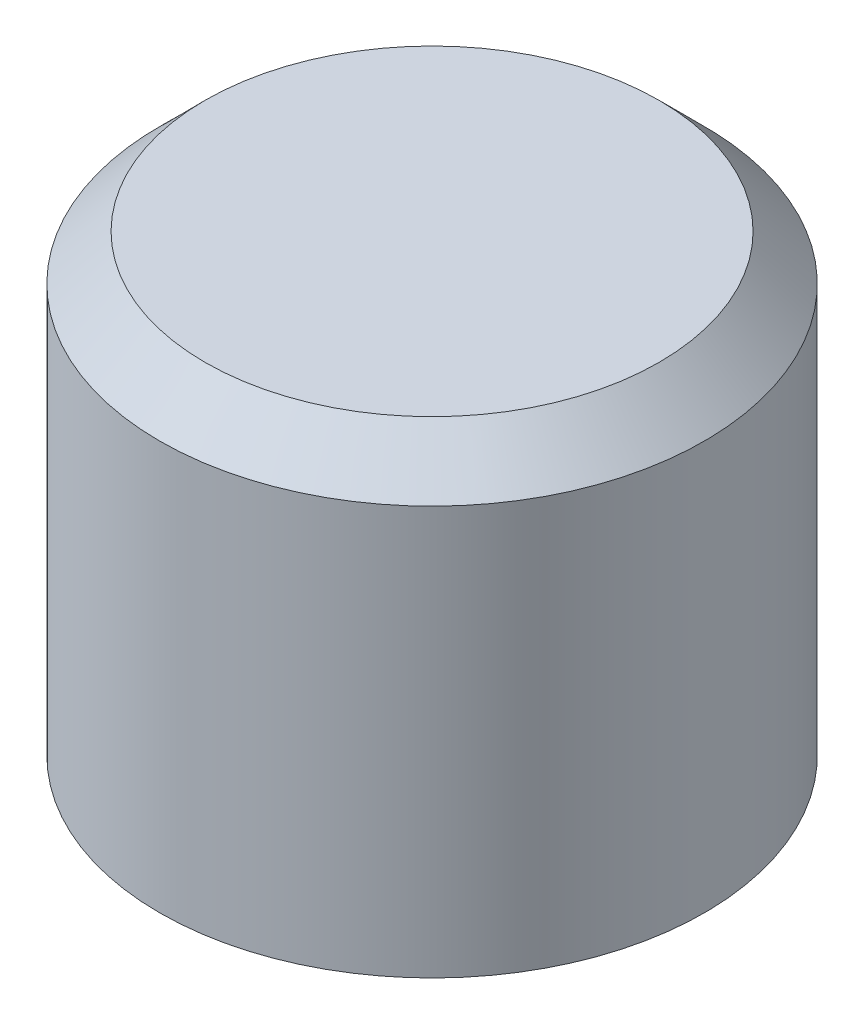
ISO-10303-21;
HEADER;
FILE_DESCRIPTION(('STEP AP214'),'2;1');
FILE_NAME('part.step','',(''),(''),'','','');
FILE_SCHEMA(('AUTOMOTIVE_DESIGN { 1 0 10303 214 1 1 1 1 }'));
ENDSEC;
DATA;
#1=APPLICATION_CONTEXT('core data for automotive mechanical design processes');
#2=APPLICATION_PROTOCOL_DEFINITION('international standard','automotive_design',2000,#1);
#3=PRODUCT_CONTEXT('',#1,'mechanical');
#4=PRODUCT('Part','Part','',(#3));
#5=PRODUCT_RELATED_PRODUCT_CATEGORY('part','',(#4));
#6=PRODUCT_DEFINITION_FORMATION('','',#4);
#7=PRODUCT_DEFINITION_CONTEXT('part definition',#1,'design');
#8=PRODUCT_DEFINITION('design','',#6,#7);
#9=PRODUCT_DEFINITION_SHAPE('','',#8);
#10=(LENGTH_UNIT() NAMED_UNIT(*) SI_UNIT(.MILLI.,.METRE.));
#11=(NAMED_UNIT(*) PLANE_ANGLE_UNIT() SI_UNIT($,.RADIAN.));
#12=(NAMED_UNIT(*) SI_UNIT($,.STERADIAN.) SOLID_ANGLE_UNIT());
#13=UNCERTAINTY_MEASURE_WITH_UNIT(LENGTH_MEASURE(1.E-05),#10,'distance_accuracy_value','');
#14=(GEOMETRIC_REPRESENTATION_CONTEXT(3) GLOBAL_UNCERTAINTY_ASSIGNED_CONTEXT((#13)) GLOBAL_UNIT_ASSIGNED_CONTEXT((#10,
#11,#12)) REPRESENTATION_CONTEXT('',''));
#15=CARTESIAN_POINT('',(0.,0.,0.));
#16=DIRECTION('',(0.,0.,1.));
#17=DIRECTION('',(1.,0.,0.));
#18=AXIS2_PLACEMENT_3D('',#15,#16,#17);
#19=CARTESIAN_POINT('',(0.,10.,0.));
#20=DIRECTION('',(0.,-1.,0.));
#21=DIRECTION('',(0.,0.,-1.));
#22=AXIS2_PLACEMENT_3D('',#19,#20,#21);
#23=CYLINDRICAL_SURFACE('',#22,6.);
#24=CARTESIAN_POINT('',(0.,9.,0.));
#25=DIRECTION('',(0.,1.,0.));
#26=DIRECTION('',(0.,0.,1.));
#27=AXIS2_PLACEMENT_3D('',#24,#25,#26);
#28=CIRCLE('',#27,6.);
#29=CARTESIAN_POINT('',(0.,9.,6.));
#30=VERTEX_POINT('',#29);
#31=EDGE_CURVE('E11',#30,#30,#28,.F.);
#32=ORIENTED_EDGE('',*,*,#31,.T.);
#33=EDGE_LOOP('',(#32));
#34=FACE_BOUND('',#33,.T.);
#35=CARTESIAN_POINT('',(0.,0.,0.));
#36=DIRECTION('',(0.,1.,0.));
#37=DIRECTION('',(0.,0.,1.));
#38=AXIS2_PLACEMENT_3D('',#35,#36,#37);
#39=CIRCLE('',#38,6.);
#40=CARTESIAN_POINT('',(0.,0.,6.));
#41=VERTEX_POINT('',#40);
#42=EDGE_CURVE('E57',#41,#41,#39,.T.);
#43=ORIENTED_EDGE('',*,*,#42,.T.);
#44=EDGE_LOOP('',(#43));
#45=FACE_BOUND('',#44,.T.);
#46=ADVANCED_FACE('F38',(#34,#45),#23,.T.);
#47=CARTESIAN_POINT('',(0.,10.,0.));
#48=DIRECTION('',(0.,1.,0.));
#49=DIRECTION('',(0.,0.,1.));
#50=AXIS2_PLACEMENT_3D('',#47,#48,#49);
#51=PLANE('',#50);
#52=CARTESIAN_POINT('',(0.,10.,0.));
#53=DIRECTION('',(0.,1.,0.));
#54=DIRECTION('',(0.,0.,1.));
#55=AXIS2_PLACEMENT_3D('',#52,#53,#54);
#56=CIRCLE('',#55,5.);
#57=CARTESIAN_POINT('',(0.,10.,5.));
#58=VERTEX_POINT('',#57);
#59=EDGE_CURVE('E45',#58,#58,#56,.T.);
#60=ORIENTED_EDGE('',*,*,#59,.T.);
#61=EDGE_LOOP('',(#60));
#62=FACE_BOUND('',#61,.T.);
#63=ADVANCED_FACE('F67',(#62),#51,.T.);
#64=CARTESIAN_POINT('',(0.,0.,0.));
#65=DIRECTION('',(0.,1.,0.));
#66=DIRECTION('',(0.,0.,1.));
#67=AXIS2_PLACEMENT_3D('',#64,#65,#66);
#68=PLANE('',#67);
#69=CARTESIAN_POINT('',(-0.116592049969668,0.,-0.0306205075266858));
#70=DIRECTION('',(0.,-1.,0.));
#71=DIRECTION('',(0.,0.,-1.));
#72=AXIS2_PLACEMENT_3D('',#69,#70,#71);
#73=CIRCLE('',#72,3.5);
#74=CARTESIAN_POINT('',(-0.116592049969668,0.,-3.53062050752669));
#75=VERTEX_POINT('',#74);
#76=EDGE_CURVE('E58',#75,#75,#73,.T.);
#77=ORIENTED_EDGE('',*,*,#76,.F.);
#78=EDGE_LOOP('',(#77));
#79=FACE_BOUND('',#78,.T.);
#80=ORIENTED_EDGE('',*,*,#42,.F.);
#81=EDGE_LOOP('',(#80));
#82=FACE_BOUND('',#81,.T.);
#83=ADVANCED_FACE('F70',(#79,#82),#68,.F.);
#84=CARTESIAN_POINT('',(0.,10.,0.));
#85=DIRECTION('',(0.,-1.,0.));
#86=DIRECTION('',(0.,0.,-1.));
#87=AXIS2_PLACEMENT_3D('',#84,#85,#86);
#88=CONICAL_SURFACE('',#87,5.,0.785398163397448);
#89=ORIENTED_EDGE('',*,*,#31,.F.);
#90=EDGE_LOOP('',(#89));
#91=FACE_BOUND('',#90,.T.);
#92=ORIENTED_EDGE('',*,*,#59,.F.);
#93=EDGE_LOOP('',(#92));
#94=FACE_BOUND('',#93,.T.);
#95=ADVANCED_FACE('F40',(#91,#94),#88,.T.);
#96=CARTESIAN_POINT('',(-0.116592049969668,6.,-0.0306205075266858));
#97=DIRECTION('',(0.,-1.,0.));
#98=DIRECTION('',(0.,0.,-1.));
#99=AXIS2_PLACEMENT_3D('',#96,#97,#98);
#100=CONICAL_SURFACE('',#99,3.5,1.02974425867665);
#101=CARTESIAN_POINT('',(-0.11659204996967,8.10301216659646,-0.0306205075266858));
#102=VERTEX_POINT('',#101);
#103=VERTEX_LOOP('',#102);
#104=FACE_BOUND('',#103,.T.);
#105=CARTESIAN_POINT('',(-0.116592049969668,6.,-0.0306205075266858));
#106=DIRECTION('',(0.,-1.,0.));
#107=DIRECTION('',(0.,0.,-1.));
#108=AXIS2_PLACEMENT_3D('',#105,#106,#107);
#109=CIRCLE('',#108,3.5);
#110=CARTESIAN_POINT('',(-0.116592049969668,6.,-3.53062050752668));
#111=VERTEX_POINT('',#110);
#112=EDGE_CURVE('E55',#111,#111,#109,.T.);
#113=ORIENTED_EDGE('',*,*,#112,.T.);
#114=EDGE_LOOP('',(#113));
#115=FACE_BOUND('',#114,.T.);
#116=ADVANCED_FACE('F48',(#104,#115),#100,.F.);
#117=CARTESIAN_POINT('',(-0.116592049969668,0.,-0.0306205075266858));
#118=DIRECTION('',(0.,-1.,0.));
#119=DIRECTION('',(0.,0.,-1.));
#120=AXIS2_PLACEMENT_3D('',#117,#118,#119);
#121=CYLINDRICAL_SURFACE('',#120,3.5);
#122=ORIENTED_EDGE('',*,*,#112,.F.);
#123=EDGE_LOOP('',(#122));
#124=FACE_BOUND('',#123,.T.);
#125=ORIENTED_EDGE('',*,*,#76,.T.);
#126=EDGE_LOOP('',(#125));
#127=FACE_BOUND('',#126,.T.);
#128=ADVANCED_FACE('F51',(#124,#127),#121,.F.);
#129=CLOSED_SHELL('',(#46,#63,#83,#95,#116,#128));
#130=MANIFOLD_SOLID_BREP('B2',#129);
#131=ADVANCED_BREP_SHAPE_REPRESENTATION('',(#18,#130),#14);
#132=SHAPE_DEFINITION_REPRESENTATION(#9,#131);
ENDSEC;
END-ISO-10303-21;
